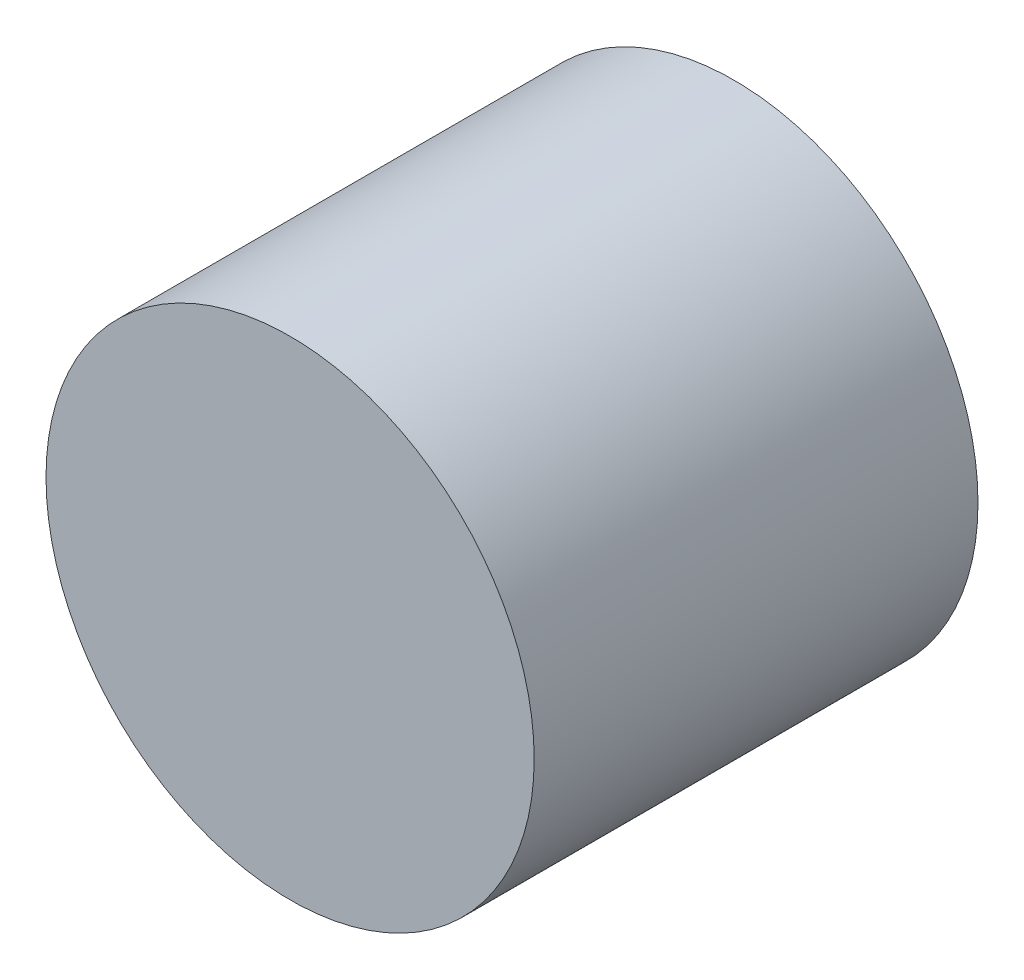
ISO-10303-21;
HEADER;
FILE_DESCRIPTION(('STEP AP214'),'2;1');
FILE_NAME('part.step','',(''),(''),'','','');
FILE_SCHEMA(('AUTOMOTIVE_DESIGN { 1 0 10303 214 1 1 1 1 }'));
ENDSEC;
DATA;
#1=APPLICATION_CONTEXT('core data for automotive mechanical design processes');
#2=APPLICATION_PROTOCOL_DEFINITION('international standard','automotive_design',2000,#1);
#3=PRODUCT_CONTEXT('',#1,'mechanical');
#4=PRODUCT('Part','Part','',(#3));
#5=PRODUCT_RELATED_PRODUCT_CATEGORY('part','',(#4));
#6=PRODUCT_DEFINITION_FORMATION('','',#4);
#7=PRODUCT_DEFINITION_CONTEXT('part definition',#1,'design');
#8=PRODUCT_DEFINITION('design','',#6,#7);
#9=PRODUCT_DEFINITION_SHAPE('','',#8);
#10=(LENGTH_UNIT() NAMED_UNIT(*) SI_UNIT(.MILLI.,.METRE.));
#11=(NAMED_UNIT(*) PLANE_ANGLE_UNIT() SI_UNIT($,.RADIAN.));
#12=(NAMED_UNIT(*) SI_UNIT($,.STERADIAN.) SOLID_ANGLE_UNIT());
#13=UNCERTAINTY_MEASURE_WITH_UNIT(LENGTH_MEASURE(1.E-05),#10,'distance_accuracy_value','');
#14=(GEOMETRIC_REPRESENTATION_CONTEXT(3) GLOBAL_UNCERTAINTY_ASSIGNED_CONTEXT((#13)) GLOBAL_UNIT_ASSIGNED_CONTEXT((#10,
#11,#12)) REPRESENTATION_CONTEXT('',''));
#15=CARTESIAN_POINT('',(0.,0.,0.));
#16=DIRECTION('',(0.,0.,1.));
#17=DIRECTION('',(1.,0.,0.));
#18=AXIS2_PLACEMENT_3D('',#15,#16,#17);
#19=CARTESIAN_POINT('',(0.,0.,-1.));
#20=DIRECTION('',(0.,0.,1.));
#21=DIRECTION('',(1.,0.,0.));
#22=AXIS2_PLACEMENT_3D('',#19,#20,#21);
#23=CYLINDRICAL_SURFACE('',#22,1.1);
#24=CARTESIAN_POINT('',(0.,0.,-1.));
#25=DIRECTION('',(0.,0.,1.));
#26=DIRECTION('',(1.,0.,0.));
#27=AXIS2_PLACEMENT_3D('',#24,#25,#26);
#28=CIRCLE('',#27,1.1);
#29=CARTESIAN_POINT('',(1.1,0.,-1.));
#30=VERTEX_POINT('',#29);
#31=EDGE_CURVE('E10',#30,#30,#28,.T.);
#32=ORIENTED_EDGE('',*,*,#31,.T.);
#33=EDGE_LOOP('',(#32));
#34=FACE_BOUND('',#33,.T.);
#35=CARTESIAN_POINT('',(0.,0.,1.));
#36=DIRECTION('',(0.,0.,1.));
#37=DIRECTION('',(1.,0.,0.));
#38=AXIS2_PLACEMENT_3D('',#35,#36,#37);
#39=CIRCLE('',#38,1.1);
#40=CARTESIAN_POINT('',(1.1,0.,1.));
#41=VERTEX_POINT('',#40);
#42=EDGE_CURVE('E46',#41,#41,#39,.T.);
#43=ORIENTED_EDGE('',*,*,#42,.F.);
#44=EDGE_LOOP('',(#43));
#45=FACE_BOUND('',#44,.T.);
#46=ADVANCED_FACE('F39',(#34,#45),#23,.T.);
#47=CARTESIAN_POINT('',(0.,0.,-1.));
#48=DIRECTION('',(0.,0.,1.));
#49=DIRECTION('',(1.,0.,0.));
#50=AXIS2_PLACEMENT_3D('',#47,#48,#49);
#51=PLANE('',#50);
#52=ORIENTED_EDGE('',*,*,#31,.F.);
#53=EDGE_LOOP('',(#52));
#54=FACE_BOUND('',#53,.T.);
#55=ADVANCED_FACE('F56',(#54),#51,.F.);
#56=CARTESIAN_POINT('',(0.,0.,1.));
#57=DIRECTION('',(0.,0.,1.));
#58=DIRECTION('',(1.,0.,0.));
#59=AXIS2_PLACEMENT_3D('',#56,#57,#58);
#60=PLANE('',#59);
#61=ORIENTED_EDGE('',*,*,#42,.T.);
#62=EDGE_LOOP('',(#61));
#63=FACE_BOUND('',#62,.T.);
#64=ADVANCED_FACE('F53',(#63),#60,.T.);
#65=CLOSED_SHELL('',(#46,#55,#64));
#66=MANIFOLD_SOLID_BREP('B2',#65);
#67=ADVANCED_BREP_SHAPE_REPRESENTATION('',(#18,#66),#14);
#68=SHAPE_DEFINITION_REPRESENTATION(#9,#67);
ENDSEC;
END-ISO-10303-21;
